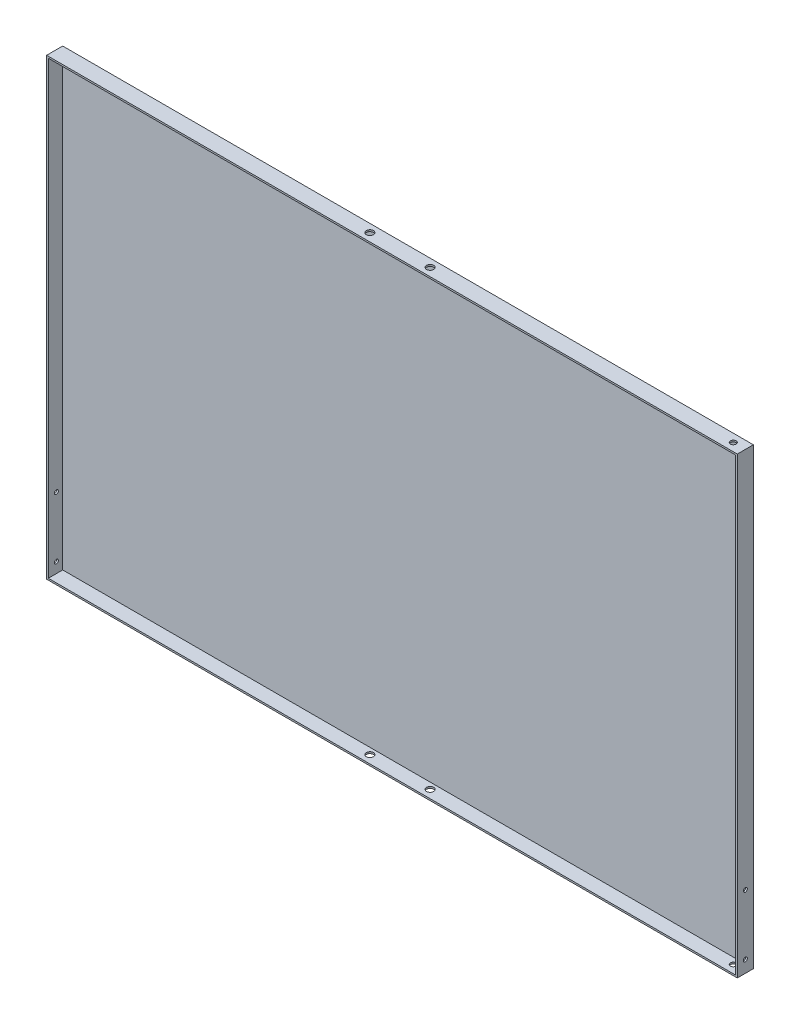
ISO-10303-21;
HEADER;
FILE_DESCRIPTION(('STEP AP214'),'2;1');
FILE_NAME('part.step','',(''),(''),'','','');
FILE_SCHEMA(('AUTOMOTIVE_DESIGN { 1 0 10303 214 1 1 1 1 }'));
ENDSEC;
DATA;
#1=APPLICATION_CONTEXT('core data for automotive mechanical design processes');
#2=APPLICATION_PROTOCOL_DEFINITION('international standard','automotive_design',2000,#1);
#3=PRODUCT_CONTEXT('',#1,'mechanical');
#4=PRODUCT('Part','Part','',(#3));
#5=PRODUCT_RELATED_PRODUCT_CATEGORY('part','',(#4));
#6=PRODUCT_DEFINITION_FORMATION('','',#4);
#7=PRODUCT_DEFINITION_CONTEXT('part definition',#1,'design');
#8=PRODUCT_DEFINITION('design','',#6,#7);
#9=PRODUCT_DEFINITION_SHAPE('','',#8);
#10=(LENGTH_UNIT() NAMED_UNIT(*) SI_UNIT(.MILLI.,.METRE.));
#11=(NAMED_UNIT(*) PLANE_ANGLE_UNIT() SI_UNIT($,.RADIAN.));
#12=(NAMED_UNIT(*) SI_UNIT($,.STERADIAN.) SOLID_ANGLE_UNIT());
#13=UNCERTAINTY_MEASURE_WITH_UNIT(LENGTH_MEASURE(1.E-05),#10,'distance_accuracy_value','');
#14=(GEOMETRIC_REPRESENTATION_CONTEXT(3) GLOBAL_UNCERTAINTY_ASSIGNED_CONTEXT((#13)) GLOBAL_UNIT_ASSIGNED_CONTEXT((#10,
#11,#12)) REPRESENTATION_CONTEXT('',''));
#15=CARTESIAN_POINT('',(0.,0.,0.));
#16=DIRECTION('',(0.,0.,1.));
#17=DIRECTION('',(1.,0.,0.));
#18=AXIS2_PLACEMENT_3D('',#15,#16,#17);
#19=CARTESIAN_POINT('',(-860.,-565.,40.));
#20=DIRECTION('',(1.,0.,0.));
#21=DIRECTION('',(0.,0.,-1.));
#22=AXIS2_PLACEMENT_3D('',#19,#20,#21);
#23=PLANE('',#22);
#24=CARTESIAN_POINT('',(-860.,-385.,19.9999999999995));
#25=DIRECTION('',(1.,0.,0.));
#26=DIRECTION('',(0.,0.,-1.));
#27=AXIS2_PLACEMENT_3D('',#24,#25,#26);
#28=CIRCLE('',#27,5.);
#29=CARTESIAN_POINT('',(-860.,-385.,14.9999999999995));
#30=VERTEX_POINT('',#29);
#31=EDGE_CURVE('E185',#30,#30,#28,.T.);
#32=ORIENTED_EDGE('',*,*,#31,.T.);
#33=EDGE_LOOP('',(#32));
#34=FACE_BOUND('',#33,.T.);
#35=CARTESIAN_POINT('',(-860.,-535.,20.));
#36=DIRECTION('',(1.,0.,0.));
#37=DIRECTION('',(0.,0.,-1.));
#38=AXIS2_PLACEMENT_3D('',#35,#36,#37);
#39=CIRCLE('',#38,5.);
#40=CARTESIAN_POINT('',(-860.,-535.,15.));
#41=VERTEX_POINT('',#40);
#42=EDGE_CURVE('E182',#41,#41,#39,.T.);
#43=ORIENTED_EDGE('',*,*,#42,.T.);
#44=EDGE_LOOP('',(#43));
#45=FACE_BOUND('',#44,.T.);
#46=DIRECTION('',(0.,-1.,0.));
#47=VECTOR('',#46,1.);
#48=CARTESIAN_POINT('',(-860.,-565.,0.));
#49=LINE('',#48,#47);
#50=CARTESIAN_POINT('',(-860.,565.,0.));
#51=VERTEX_POINT('',#50);
#52=CARTESIAN_POINT('',(-860.,-565.,0.));
#53=VERTEX_POINT('',#52);
#54=EDGE_CURVE('E149',#51,#53,#49,.T.);
#55=ORIENTED_EDGE('',*,*,#54,.T.);
#56=DIRECTION('',(0.,0.,-1.));
#57=VECTOR('',#56,1.);
#58=CARTESIAN_POINT('',(-860.,-565.,40.));
#59=LINE('',#58,#57);
#60=CARTESIAN_POINT('',(-860.,-565.,40.));
#61=VERTEX_POINT('',#60);
#62=EDGE_CURVE('E11',#61,#53,#59,.T.);
#63=ORIENTED_EDGE('',*,*,#62,.F.);
#64=DIRECTION('',(0.,-1.,0.));
#65=VECTOR('',#64,1.);
#66=CARTESIAN_POINT('',(-860.,-565.,40.));
#67=LINE('',#66,#65);
#68=CARTESIAN_POINT('',(-860.,565.,40.));
#69=VERTEX_POINT('',#68);
#70=EDGE_CURVE('E142',#69,#61,#67,.T.);
#71=ORIENTED_EDGE('',*,*,#70,.F.);
#72=DIRECTION('',(0.,0.,-1.));
#73=VECTOR('',#72,1.);
#74=CARTESIAN_POINT('',(-860.,565.,40.));
#75=LINE('',#74,#73);
#76=EDGE_CURVE('E148',#69,#51,#75,.T.);
#77=ORIENTED_EDGE('',*,*,#76,.T.);
#78=EDGE_LOOP('',(#55,#63,#71,#77));
#79=FACE_BOUND('',#78,.T.);
#80=ADVANCED_FACE('F33',(#34,#45,#79),#23,.F.);
#81=CARTESIAN_POINT('',(860.,-565.,40.));
#82=DIRECTION('',(0.,1.,0.));
#83=DIRECTION('',(-1.,0.,0.));
#84=AXIS2_PLACEMENT_3D('',#81,#82,#83);
#85=PLANE('',#84);
#86=CARTESIAN_POINT('',(-74.9999999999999,-565.,19.9999999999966));
#87=DIRECTION('',(0.,1.,0.));
#88=DIRECTION('',(-1.,0.,0.));
#89=AXIS2_PLACEMENT_3D('',#86,#87,#88);
#90=CIRCLE('',#89,8.95251953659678);
#91=CARTESIAN_POINT('',(-83.9525195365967,-565.,19.9999999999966));
#92=VERTEX_POINT('',#91);
#93=EDGE_CURVE('E171',#92,#92,#90,.T.);
#94=ORIENTED_EDGE('',*,*,#93,.T.);
#95=EDGE_LOOP('',(#94));
#96=FACE_BOUND('',#95,.T.);
#97=CARTESIAN_POINT('',(75.0000000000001,-565.,19.9999999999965));
#98=DIRECTION('',(0.,1.,0.));
#99=DIRECTION('',(1.,0.,0.));
#100=AXIS2_PLACEMENT_3D('',#97,#98,#99);
#101=CIRCLE('',#100,8.95251953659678);
#102=CARTESIAN_POINT('',(83.9525195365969,-565.,19.9999999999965));
#103=VERTEX_POINT('',#102);
#104=EDGE_CURVE('E202',#103,#103,#101,.T.);
#105=ORIENTED_EDGE('',*,*,#104,.T.);
#106=EDGE_LOOP('',(#105));
#107=FACE_BOUND('',#106,.T.);
#108=CARTESIAN_POINT('',(830.,-565.,19.9999999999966));
#109=DIRECTION('',(0.,1.,0.));
#110=DIRECTION('',(-1.,0.,0.));
#111=AXIS2_PLACEMENT_3D('',#108,#109,#110);
#112=CIRCLE('',#111,7.18021218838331);
#113=CARTESIAN_POINT('',(822.819787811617,-565.,19.9999999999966));
#114=VERTEX_POINT('',#113);
#115=EDGE_CURVE('E166',#114,#114,#112,.T.);
#116=ORIENTED_EDGE('',*,*,#115,.T.);
#117=EDGE_LOOP('',(#116));
#118=FACE_BOUND('',#117,.T.);
#119=DIRECTION('',(1.,0.,0.));
#120=VECTOR('',#119,1.);
#121=CARTESIAN_POINT('',(860.,-565.,0.));
#122=LINE('',#121,#120);
#123=CARTESIAN_POINT('',(860.,-565.,0.));
#124=VERTEX_POINT('',#123);
#125=EDGE_CURVE('E152',#53,#124,#122,.T.);
#126=ORIENTED_EDGE('',*,*,#125,.T.);
#127=DIRECTION('',(0.,0.,-1.));
#128=VECTOR('',#127,1.);
#129=CARTESIAN_POINT('',(860.,-565.,40.));
#130=LINE('',#129,#128);
#131=CARTESIAN_POINT('',(860.,-565.,40.));
#132=VERTEX_POINT('',#131);
#133=EDGE_CURVE('E41',#132,#124,#130,.T.);
#134=ORIENTED_EDGE('',*,*,#133,.F.);
#135=DIRECTION('',(1.,0.,0.));
#136=VECTOR('',#135,1.);
#137=CARTESIAN_POINT('',(860.,-565.,40.));
#138=LINE('',#137,#136);
#139=EDGE_CURVE('E86',#61,#132,#138,.T.);
#140=ORIENTED_EDGE('',*,*,#139,.F.);
#141=ORIENTED_EDGE('',*,*,#62,.T.);
#142=EDGE_LOOP('',(#126,#134,#140,#141));
#143=FACE_BOUND('',#142,.T.);
#144=ADVANCED_FACE('F237',(#96,#107,#118,#143),#85,.F.);
#145=CARTESIAN_POINT('',(860.,-565.,40.));
#146=DIRECTION('',(-1.,0.,0.));
#147=DIRECTION('',(0.,0.,1.));
#148=AXIS2_PLACEMENT_3D('',#145,#146,#147);
#149=PLANE('',#148);
#150=CARTESIAN_POINT('',(860.,-385.,19.9999999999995));
#151=DIRECTION('',(-1.,0.,0.));
#152=DIRECTION('',(0.,0.,1.));
#153=AXIS2_PLACEMENT_3D('',#150,#151,#152);
#154=CIRCLE('',#153,5.);
#155=CARTESIAN_POINT('',(860.,-385.,24.9999999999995));
#156=VERTEX_POINT('',#155);
#157=EDGE_CURVE('E371',#156,#156,#154,.T.);
#158=ORIENTED_EDGE('',*,*,#157,.T.);
#159=EDGE_LOOP('',(#158));
#160=FACE_BOUND('',#159,.T.);
#161=CARTESIAN_POINT('',(860.,-535.,20.));
#162=DIRECTION('',(-1.,0.,0.));
#163=DIRECTION('',(0.,0.,1.));
#164=AXIS2_PLACEMENT_3D('',#161,#162,#163);
#165=CIRCLE('',#164,5.);
#166=CARTESIAN_POINT('',(860.,-535.,25.));
#167=VERTEX_POINT('',#166);
#168=EDGE_CURVE('E178',#167,#167,#165,.T.);
#169=ORIENTED_EDGE('',*,*,#168,.T.);
#170=EDGE_LOOP('',(#169));
#171=FACE_BOUND('',#170,.T.);
#172=DIRECTION('',(0.,1.,0.));
#173=VECTOR('',#172,1.);
#174=CARTESIAN_POINT('',(860.,-565.,0.));
#175=LINE('',#174,#173);
#176=CARTESIAN_POINT('',(860.,565.,0.));
#177=VERTEX_POINT('',#176);
#178=EDGE_CURVE('E154',#124,#177,#175,.T.);
#179=ORIENTED_EDGE('',*,*,#178,.T.);
#180=DIRECTION('',(0.,0.,-1.));
#181=VECTOR('',#180,1.);
#182=CARTESIAN_POINT('',(860.,565.,40.));
#183=LINE('',#182,#181);
#184=CARTESIAN_POINT('',(860.,565.,40.));
#185=VERTEX_POINT('',#184);
#186=EDGE_CURVE('E158',#185,#177,#183,.T.);
#187=ORIENTED_EDGE('',*,*,#186,.F.);
#188=DIRECTION('',(0.,1.,0.));
#189=VECTOR('',#188,1.);
#190=CARTESIAN_POINT('',(860.,-565.,40.));
#191=LINE('',#190,#189);
#192=EDGE_CURVE('E145',#132,#185,#191,.T.);
#193=ORIENTED_EDGE('',*,*,#192,.F.);
#194=ORIENTED_EDGE('',*,*,#133,.T.);
#195=EDGE_LOOP('',(#179,#187,#193,#194));
#196=FACE_BOUND('',#195,.T.);
#197=ADVANCED_FACE('F242',(#160,#171,#196),#149,.F.);
#198=CARTESIAN_POINT('',(860.,565.,40.));
#199=DIRECTION('',(0.,-1.,0.));
#200=DIRECTION('',(1.,0.,0.));
#201=AXIS2_PLACEMENT_3D('',#198,#199,#200);
#202=PLANE('',#201);
#203=CARTESIAN_POINT('',(-75.0000000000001,565.,19.9999999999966));
#204=DIRECTION('',(0.,1.,0.));
#205=DIRECTION('',(-1.,0.,0.));
#206=AXIS2_PLACEMENT_3D('',#203,#204,#205);
#207=CIRCLE('',#206,8.95251953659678);
#208=CARTESIAN_POINT('',(-83.9525195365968,565.,19.9999999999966));
#209=VERTEX_POINT('',#208);
#210=EDGE_CURVE('E199',#209,#209,#207,.T.);
#211=ORIENTED_EDGE('',*,*,#210,.F.);
#212=EDGE_LOOP('',(#211));
#213=FACE_BOUND('',#212,.T.);
#214=CARTESIAN_POINT('',(74.9999999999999,565.,19.9999999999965));
#215=DIRECTION('',(0.,1.,0.));
#216=DIRECTION('',(1.,0.,0.));
#217=AXIS2_PLACEMENT_3D('',#214,#215,#216);
#218=CIRCLE('',#217,8.95251953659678);
#219=CARTESIAN_POINT('',(83.9525195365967,565.,19.9999999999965));
#220=VERTEX_POINT('',#219);
#221=EDGE_CURVE('E196',#220,#220,#218,.T.);
#222=ORIENTED_EDGE('',*,*,#221,.F.);
#223=EDGE_LOOP('',(#222));
#224=FACE_BOUND('',#223,.T.);
#225=CARTESIAN_POINT('',(830.,565.,19.9999999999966));
#226=DIRECTION('',(0.,1.,0.));
#227=DIRECTION('',(-1.,0.,0.));
#228=AXIS2_PLACEMENT_3D('',#225,#226,#227);
#229=CIRCLE('',#228,7.18021218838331);
#230=CARTESIAN_POINT('',(822.819787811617,565.,19.9999999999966));
#231=VERTEX_POINT('',#230);
#232=EDGE_CURVE('E211',#231,#231,#229,.T.);
#233=ORIENTED_EDGE('',*,*,#232,.F.);
#234=EDGE_LOOP('',(#233));
#235=FACE_BOUND('',#234,.T.);
#236=DIRECTION('',(-1.,0.,0.));
#237=VECTOR('',#236,1.);
#238=CARTESIAN_POINT('',(860.,565.,0.));
#239=LINE('',#238,#237);
#240=EDGE_CURVE('E79',#177,#51,#239,.T.);
#241=ORIENTED_EDGE('',*,*,#240,.T.);
#242=ORIENTED_EDGE('',*,*,#76,.F.);
#243=DIRECTION('',(-1.,0.,0.));
#244=VECTOR('',#243,1.);
#245=CARTESIAN_POINT('',(860.,565.,40.));
#246=LINE('',#245,#244);
#247=EDGE_CURVE('E58',#185,#69,#246,.T.);
#248=ORIENTED_EDGE('',*,*,#247,.F.);
#249=ORIENTED_EDGE('',*,*,#186,.T.);
#250=EDGE_LOOP('',(#241,#242,#248,#249));
#251=FACE_BOUND('',#250,.T.);
#252=ADVANCED_FACE('F231',(#213,#224,#235,#251),#202,.F.);
#253=CARTESIAN_POINT('',(0.,0.,40.));
#254=DIRECTION('',(0.,0.,1.));
#255=DIRECTION('',(1.,0.,0.));
#256=AXIS2_PLACEMENT_3D('',#253,#254,#255);
#257=PLANE('',#256);
#258=DIRECTION('',(0.,-1.,0.));
#259=VECTOR('',#258,1.);
#260=CARTESIAN_POINT('',(-855.775639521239,-565.,40.));
#261=LINE('',#260,#259);
#262=CARTESIAN_POINT('',(-855.775639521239,560.775639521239,40.));
#263=VERTEX_POINT('',#262);
#264=CARTESIAN_POINT('',(-855.775639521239,-560.775639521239,40.));
#265=VERTEX_POINT('',#264);
#266=EDGE_CURVE('E131',#263,#265,#261,.T.);
#267=ORIENTED_EDGE('',*,*,#266,.F.);
#268=DIRECTION('',(-1.,0.,0.));
#269=VECTOR('',#268,1.);
#270=CARTESIAN_POINT('',(860.,560.775639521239,40.));
#271=LINE('',#270,#269);
#272=CARTESIAN_POINT('',(855.775639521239,560.775639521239,40.));
#273=VERTEX_POINT('',#272);
#274=EDGE_CURVE('E140',#273,#263,#271,.T.);
#275=ORIENTED_EDGE('',*,*,#274,.F.);
#276=DIRECTION('',(0.,1.,0.));
#277=VECTOR('',#276,1.);
#278=CARTESIAN_POINT('',(855.775639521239,-565.,40.));
#279=LINE('',#278,#277);
#280=CARTESIAN_POINT('',(855.775639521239,-560.775639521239,40.));
#281=VERTEX_POINT('',#280);
#282=EDGE_CURVE('E138',#281,#273,#279,.T.);
#283=ORIENTED_EDGE('',*,*,#282,.F.);
#284=DIRECTION('',(1.,0.,0.));
#285=VECTOR('',#284,1.);
#286=CARTESIAN_POINT('',(860.,-560.775639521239,40.));
#287=LINE('',#286,#285);
#288=EDGE_CURVE('E123',#265,#281,#287,.T.);
#289=ORIENTED_EDGE('',*,*,#288,.F.);
#290=EDGE_LOOP('',(#267,#275,#283,#289));
#291=FACE_BOUND('',#290,.T.);
#292=ORIENTED_EDGE('',*,*,#70,.T.);
#293=ORIENTED_EDGE('',*,*,#139,.T.);
#294=ORIENTED_EDGE('',*,*,#192,.T.);
#295=ORIENTED_EDGE('',*,*,#247,.T.);
#296=EDGE_LOOP('',(#292,#293,#294,#295));
#297=FACE_BOUND('',#296,.T.);
#298=ADVANCED_FACE('F228',(#291,#297),#257,.T.);
#299=CARTESIAN_POINT('',(0.,0.,0.));
#300=DIRECTION('',(0.,0.,1.));
#301=DIRECTION('',(1.,0.,0.));
#302=AXIS2_PLACEMENT_3D('',#299,#300,#301);
#303=PLANE('',#302);
#304=ORIENTED_EDGE('',*,*,#54,.F.);
#305=ORIENTED_EDGE('',*,*,#240,.F.);
#306=ORIENTED_EDGE('',*,*,#178,.F.);
#307=ORIENTED_EDGE('',*,*,#125,.F.);
#308=EDGE_LOOP('',(#304,#305,#306,#307));
#309=FACE_BOUND('',#308,.T.);
#310=ADVANCED_FACE('F230',(#309),#303,.F.);
#311=CARTESIAN_POINT('',(-855.775639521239,-565.,40.));
#312=DIRECTION('',(1.,0.,0.));
#313=DIRECTION('',(0.,0.,-1.));
#314=AXIS2_PLACEMENT_3D('',#311,#312,#313);
#315=PLANE('',#314);
#316=CARTESIAN_POINT('',(-855.775639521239,-385.,19.9999999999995));
#317=DIRECTION('',(1.,0.,0.));
#318=DIRECTION('',(0.,0.,-1.));
#319=AXIS2_PLACEMENT_3D('',#316,#317,#318);
#320=CIRCLE('',#319,5.);
#321=CARTESIAN_POINT('',(-855.775639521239,-385.,14.9999999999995));
#322=VERTEX_POINT('',#321);
#323=EDGE_CURVE('E190',#322,#322,#320,.T.);
#324=ORIENTED_EDGE('',*,*,#323,.F.);
#325=EDGE_LOOP('',(#324));
#326=FACE_BOUND('',#325,.T.);
#327=CARTESIAN_POINT('',(-855.775639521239,-535.,20.));
#328=DIRECTION('',(1.,0.,0.));
#329=DIRECTION('',(0.,0.,-1.));
#330=AXIS2_PLACEMENT_3D('',#327,#328,#329);
#331=CIRCLE('',#330,5.);
#332=CARTESIAN_POINT('',(-855.775639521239,-535.,15.));
#333=VERTEX_POINT('',#332);
#334=EDGE_CURVE('E177',#333,#333,#331,.T.);
#335=ORIENTED_EDGE('',*,*,#334,.F.);
#336=EDGE_LOOP('',(#335));
#337=FACE_BOUND('',#336,.T.);
#338=DIRECTION('',(0.,-1.,0.));
#339=VECTOR('',#338,1.);
#340=CARTESIAN_POINT('',(-855.775639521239,-565.,4.22436047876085));
#341=LINE('',#340,#339);
#342=CARTESIAN_POINT('',(-855.775639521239,560.775639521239,4.22436047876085));
#343=VERTEX_POINT('',#342);
#344=CARTESIAN_POINT('',(-855.775639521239,-560.775639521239,4.22436047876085));
#345=VERTEX_POINT('',#344);
#346=EDGE_CURVE('E114',#343,#345,#341,.T.);
#347=ORIENTED_EDGE('',*,*,#346,.F.);
#348=DIRECTION('',(0.,0.,-1.));
#349=VECTOR('',#348,1.);
#350=CARTESIAN_POINT('',(-855.775639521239,560.775639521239,40.));
#351=LINE('',#350,#349);
#352=EDGE_CURVE('E134',#263,#343,#351,.T.);
#353=ORIENTED_EDGE('',*,*,#352,.F.);
#354=ORIENTED_EDGE('',*,*,#266,.T.);
#355=DIRECTION('',(0.,0.,-1.));
#356=VECTOR('',#355,1.);
#357=CARTESIAN_POINT('',(-855.775639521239,-560.775639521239,40.));
#358=LINE('',#357,#356);
#359=EDGE_CURVE('E126',#265,#345,#358,.T.);
#360=ORIENTED_EDGE('',*,*,#359,.T.);
#361=EDGE_LOOP('',(#347,#353,#354,#360));
#362=FACE_BOUND('',#361,.T.);
#363=ADVANCED_FACE('F226',(#326,#337,#362),#315,.T.);
#364=CARTESIAN_POINT('',(860.,-560.775639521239,40.));
#365=DIRECTION('',(0.,1.,0.));
#366=DIRECTION('',(-1.,0.,0.));
#367=AXIS2_PLACEMENT_3D('',#364,#365,#366);
#368=PLANE('',#367);
#369=CARTESIAN_POINT('',(-74.9999999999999,-560.775639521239,19.9999999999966));
#370=DIRECTION('',(0.,1.,0.));
#371=DIRECTION('',(-1.,0.,0.));
#372=AXIS2_PLACEMENT_3D('',#369,#370,#371);
#373=CIRCLE('',#372,8.95251953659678);
#374=CARTESIAN_POINT('',(-83.9525195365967,-560.775639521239,19.9999999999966));
#375=VERTEX_POINT('',#374);
#376=EDGE_CURVE('E174',#375,#375,#373,.T.);
#377=ORIENTED_EDGE('',*,*,#376,.F.);
#378=EDGE_LOOP('',(#377));
#379=FACE_BOUND('',#378,.T.);
#380=CARTESIAN_POINT('',(75.0000000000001,-560.775639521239,19.9999999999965));
#381=DIRECTION('',(0.,1.,0.));
#382=DIRECTION('',(-1.,0.,0.));
#383=AXIS2_PLACEMENT_3D('',#380,#381,#382);
#384=CIRCLE('',#383,8.95251953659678);
#385=CARTESIAN_POINT('',(66.0474804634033,-560.775639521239,19.9999999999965));
#386=VERTEX_POINT('',#385);
#387=EDGE_CURVE('E170',#386,#386,#384,.T.);
#388=ORIENTED_EDGE('',*,*,#387,.F.);
#389=EDGE_LOOP('',(#388));
#390=FACE_BOUND('',#389,.T.);
#391=CARTESIAN_POINT('',(830.,-560.775639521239,19.9999999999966));
#392=DIRECTION('',(0.,1.,0.));
#393=DIRECTION('',(-1.,0.,0.));
#394=AXIS2_PLACEMENT_3D('',#391,#392,#393);
#395=CIRCLE('',#394,7.18021218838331);
#396=CARTESIAN_POINT('',(822.819787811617,-560.775639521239,19.9999999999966));
#397=VERTEX_POINT('',#396);
#398=EDGE_CURVE('E165',#397,#397,#395,.T.);
#399=ORIENTED_EDGE('',*,*,#398,.F.);
#400=EDGE_LOOP('',(#399));
#401=FACE_BOUND('',#400,.T.);
#402=DIRECTION('',(1.,0.,0.));
#403=VECTOR('',#402,1.);
#404=CARTESIAN_POINT('',(860.,-560.775639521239,4.22436047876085));
#405=LINE('',#404,#403);
#406=CARTESIAN_POINT('',(855.775639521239,-560.775639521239,4.22436047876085));
#407=VERTEX_POINT('',#406);
#408=EDGE_CURVE('E108',#345,#407,#405,.T.);
#409=ORIENTED_EDGE('',*,*,#408,.F.);
#410=ORIENTED_EDGE('',*,*,#359,.F.);
#411=ORIENTED_EDGE('',*,*,#288,.T.);
#412=DIRECTION('',(0.,0.,-1.));
#413=VECTOR('',#412,1.);
#414=CARTESIAN_POINT('',(855.775639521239,-560.775639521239,40.));
#415=LINE('',#414,#413);
#416=EDGE_CURVE('E120',#281,#407,#415,.T.);
#417=ORIENTED_EDGE('',*,*,#416,.T.);
#418=EDGE_LOOP('',(#409,#410,#411,#417));
#419=FACE_BOUND('',#418,.T.);
#420=ADVANCED_FACE('F121',(#379,#390,#401,#419),#368,.T.);
#421=CARTESIAN_POINT('',(855.775639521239,-565.,40.));
#422=DIRECTION('',(-1.,0.,0.));
#423=DIRECTION('',(0.,0.,1.));
#424=AXIS2_PLACEMENT_3D('',#421,#422,#423);
#425=PLANE('',#424);
#426=CARTESIAN_POINT('',(855.775639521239,-385.,19.9999999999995));
#427=DIRECTION('',(-1.,0.,0.));
#428=DIRECTION('',(0.,0.,1.));
#429=AXIS2_PLACEMENT_3D('',#426,#427,#428);
#430=CIRCLE('',#429,5.);
#431=CARTESIAN_POINT('',(855.775639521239,-385.,24.9999999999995));
#432=VERTEX_POINT('',#431);
#433=EDGE_CURVE('E36',#432,#432,#430,.T.);
#434=ORIENTED_EDGE('',*,*,#433,.F.);
#435=EDGE_LOOP('',(#434));
#436=FACE_BOUND('',#435,.T.);
#437=CARTESIAN_POINT('',(855.775639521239,-535.,20.));
#438=DIRECTION('',(-1.,0.,0.));
#439=DIRECTION('',(0.,0.,1.));
#440=AXIS2_PLACEMENT_3D('',#437,#438,#439);
#441=CIRCLE('',#440,5.);
#442=CARTESIAN_POINT('',(855.775639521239,-535.,25.));
#443=VERTEX_POINT('',#442);
#444=EDGE_CURVE('E175',#443,#443,#441,.T.);
#445=ORIENTED_EDGE('',*,*,#444,.F.);
#446=EDGE_LOOP('',(#445));
#447=FACE_BOUND('',#446,.T.);
#448=DIRECTION('',(0.,1.,0.));
#449=VECTOR('',#448,1.);
#450=CARTESIAN_POINT('',(855.775639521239,-565.,4.22436047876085));
#451=LINE('',#450,#449);
#452=CARTESIAN_POINT('',(855.775639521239,560.775639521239,4.22436047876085));
#453=VERTEX_POINT('',#452);
#454=EDGE_CURVE('E112',#407,#453,#451,.T.);
#455=ORIENTED_EDGE('',*,*,#454,.F.);
#456=ORIENTED_EDGE('',*,*,#416,.F.);
#457=ORIENTED_EDGE('',*,*,#282,.T.);
#458=DIRECTION('',(0.,0.,-1.));
#459=VECTOR('',#458,1.);
#460=CARTESIAN_POINT('',(855.775639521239,560.775639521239,40.));
#461=LINE('',#460,#459);
#462=EDGE_CURVE('E49',#273,#453,#461,.T.);
#463=ORIENTED_EDGE('',*,*,#462,.T.);
#464=EDGE_LOOP('',(#455,#456,#457,#463));
#465=FACE_BOUND('',#464,.T.);
#466=ADVANCED_FACE('F128',(#436,#447,#465),#425,.T.);
#467=CARTESIAN_POINT('',(860.,560.775639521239,40.));
#468=DIRECTION('',(0.,-1.,0.));
#469=DIRECTION('',(1.,0.,0.));
#470=AXIS2_PLACEMENT_3D('',#467,#468,#469);
#471=PLANE('',#470);
#472=CARTESIAN_POINT('',(-75.0000000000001,560.775639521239,19.9999999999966));
#473=DIRECTION('',(0.,-1.,0.));
#474=DIRECTION('',(1.,0.,0.));
#475=AXIS2_PLACEMENT_3D('',#472,#473,#474);
#476=CIRCLE('',#475,8.95251953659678);
#477=CARTESIAN_POINT('',(-66.0474804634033,560.775639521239,19.9999999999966));
#478=VERTEX_POINT('',#477);
#479=EDGE_CURVE('E172',#478,#478,#476,.T.);
#480=ORIENTED_EDGE('',*,*,#479,.F.);
#481=EDGE_LOOP('',(#480));
#482=FACE_BOUND('',#481,.T.);
#483=CARTESIAN_POINT('',(74.9999999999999,560.775639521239,19.9999999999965));
#484=DIRECTION('',(0.,-1.,0.));
#485=DIRECTION('',(1.,0.,0.));
#486=AXIS2_PLACEMENT_3D('',#483,#484,#485);
#487=CIRCLE('',#486,8.95251953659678);
#488=CARTESIAN_POINT('',(83.9525195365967,560.775639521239,19.9999999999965));
#489=VERTEX_POINT('',#488);
#490=EDGE_CURVE('E167',#489,#489,#487,.T.);
#491=ORIENTED_EDGE('',*,*,#490,.F.);
#492=EDGE_LOOP('',(#491));
#493=FACE_BOUND('',#492,.T.);
#494=CARTESIAN_POINT('',(830.,560.775639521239,19.9999999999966));
#495=DIRECTION('',(0.,-1.,0.));
#496=DIRECTION('',(1.,0.,0.));
#497=AXIS2_PLACEMENT_3D('',#494,#495,#496);
#498=CIRCLE('',#497,7.18021218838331);
#499=CARTESIAN_POINT('',(837.180212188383,560.775639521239,19.9999999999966));
#500=VERTEX_POINT('',#499);
#501=EDGE_CURVE('E162',#500,#500,#498,.T.);
#502=ORIENTED_EDGE('',*,*,#501,.F.);
#503=EDGE_LOOP('',(#502));
#504=FACE_BOUND('',#503,.T.);
#505=DIRECTION('',(-1.,0.,0.));
#506=VECTOR('',#505,1.);
#507=CARTESIAN_POINT('',(860.,560.775639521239,4.22436047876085));
#508=LINE('',#507,#506);
#509=EDGE_CURVE('E129',#453,#343,#508,.T.);
#510=ORIENTED_EDGE('',*,*,#509,.F.);
#511=ORIENTED_EDGE('',*,*,#462,.F.);
#512=ORIENTED_EDGE('',*,*,#274,.T.);
#513=ORIENTED_EDGE('',*,*,#352,.T.);
#514=EDGE_LOOP('',(#510,#511,#512,#513));
#515=FACE_BOUND('',#514,.T.);
#516=ADVANCED_FACE('F222',(#482,#493,#504,#515),#471,.T.);
#517=CARTESIAN_POINT('',(0.,0.,4.22436047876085));
#518=DIRECTION('',(0.,0.,1.));
#519=DIRECTION('',(1.,0.,0.));
#520=AXIS2_PLACEMENT_3D('',#517,#518,#519);
#521=PLANE('',#520);
#522=ORIENTED_EDGE('',*,*,#346,.T.);
#523=ORIENTED_EDGE('',*,*,#408,.T.);
#524=ORIENTED_EDGE('',*,*,#454,.T.);
#525=ORIENTED_EDGE('',*,*,#509,.T.);
#526=EDGE_LOOP('',(#522,#523,#524,#525));
#527=FACE_BOUND('',#526,.T.);
#528=ADVANCED_FACE('F110',(#527),#521,.T.);
#529=CARTESIAN_POINT('',(830.,-565.,19.9999999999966));
#530=DIRECTION('',(0.,1.,0.));
#531=DIRECTION('',(-1.,0.,0.));
#532=AXIS2_PLACEMENT_3D('',#529,#530,#531);
#533=CYLINDRICAL_SURFACE('',#532,7.18021218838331);
#534=ORIENTED_EDGE('',*,*,#501,.T.);
#535=EDGE_LOOP('',(#534));
#536=FACE_BOUND('',#535,.T.);
#537=ORIENTED_EDGE('',*,*,#232,.T.);
#538=EDGE_LOOP('',(#537));
#539=FACE_BOUND('',#538,.T.);
#540=ADVANCED_FACE('F287',(#536,#539),#533,.F.);
#541=ORIENTED_EDGE('',*,*,#398,.T.);
#542=EDGE_LOOP('',(#541));
#543=FACE_BOUND('',#542,.T.);
#544=ORIENTED_EDGE('',*,*,#115,.F.);
#545=EDGE_LOOP('',(#544));
#546=FACE_BOUND('',#545,.T.);
#547=ADVANCED_FACE('F285',(#543,#546),#533,.F.);
#548=CARTESIAN_POINT('',(75.0000000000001,-565.,19.9999999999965));
#549=DIRECTION('',(0.,1.,0.));
#550=DIRECTION('',(-1.,0.,0.));
#551=AXIS2_PLACEMENT_3D('',#548,#549,#550);
#552=CYLINDRICAL_SURFACE('',#551,8.95251953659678);
#553=ORIENTED_EDGE('',*,*,#490,.T.);
#554=EDGE_LOOP('',(#553));
#555=FACE_BOUND('',#554,.T.);
#556=ORIENTED_EDGE('',*,*,#221,.T.);
#557=EDGE_LOOP('',(#556));
#558=FACE_BOUND('',#557,.T.);
#559=ADVANCED_FACE('F281',(#555,#558),#552,.F.);
#560=CARTESIAN_POINT('',(-74.9999999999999,-565.,19.9999999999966));
#561=DIRECTION('',(0.,1.,0.));
#562=DIRECTION('',(-1.,0.,0.));
#563=AXIS2_PLACEMENT_3D('',#560,#561,#562);
#564=CYLINDRICAL_SURFACE('',#563,8.95251953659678);
#565=ORIENTED_EDGE('',*,*,#479,.T.);
#566=EDGE_LOOP('',(#565));
#567=FACE_BOUND('',#566,.T.);
#568=ORIENTED_EDGE('',*,*,#210,.T.);
#569=EDGE_LOOP('',(#568));
#570=FACE_BOUND('',#569,.T.);
#571=ADVANCED_FACE('F277',(#567,#570),#564,.F.);
#572=ORIENTED_EDGE('',*,*,#387,.T.);
#573=EDGE_LOOP('',(#572));
#574=FACE_BOUND('',#573,.T.);
#575=ORIENTED_EDGE('',*,*,#104,.F.);
#576=EDGE_LOOP('',(#575));
#577=FACE_BOUND('',#576,.T.);
#578=ADVANCED_FACE('F280',(#574,#577),#552,.F.);
#579=ORIENTED_EDGE('',*,*,#376,.T.);
#580=EDGE_LOOP('',(#579));
#581=FACE_BOUND('',#580,.T.);
#582=ORIENTED_EDGE('',*,*,#93,.F.);
#583=EDGE_LOOP('',(#582));
#584=FACE_BOUND('',#583,.T.);
#585=ADVANCED_FACE('F275',(#581,#584),#564,.F.);
#586=CARTESIAN_POINT('',(860.,-535.,20.));
#587=DIRECTION('',(-1.,0.,0.));
#588=DIRECTION('',(0.,0.,1.));
#589=AXIS2_PLACEMENT_3D('',#586,#587,#588);
#590=CYLINDRICAL_SURFACE('',#589,5.);
#591=ORIENTED_EDGE('',*,*,#444,.T.);
#592=EDGE_LOOP('',(#591));
#593=FACE_BOUND('',#592,.T.);
#594=ORIENTED_EDGE('',*,*,#168,.F.);
#595=EDGE_LOOP('',(#594));
#596=FACE_BOUND('',#595,.T.);
#597=ADVANCED_FACE('F265',(#593,#596),#590,.F.);
#598=ORIENTED_EDGE('',*,*,#334,.T.);
#599=EDGE_LOOP('',(#598));
#600=FACE_BOUND('',#599,.T.);
#601=ORIENTED_EDGE('',*,*,#42,.F.);
#602=EDGE_LOOP('',(#601));
#603=FACE_BOUND('',#602,.T.);
#604=ADVANCED_FACE('F262',(#600,#603),#590,.F.);
#605=CARTESIAN_POINT('',(860.,-385.,19.9999999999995));
#606=DIRECTION('',(-1.,0.,0.));
#607=DIRECTION('',(0.,0.,1.));
#608=AXIS2_PLACEMENT_3D('',#605,#606,#607);
#609=CYLINDRICAL_SURFACE('',#608,5.);
#610=ORIENTED_EDGE('',*,*,#433,.T.);
#611=EDGE_LOOP('',(#610));
#612=FACE_BOUND('',#611,.T.);
#613=ORIENTED_EDGE('',*,*,#157,.F.);
#614=EDGE_LOOP('',(#613));
#615=FACE_BOUND('',#614,.T.);
#616=ADVANCED_FACE('F264',(#612,#615),#609,.F.);
#617=ORIENTED_EDGE('',*,*,#323,.T.);
#618=EDGE_LOOP('',(#617));
#619=FACE_BOUND('',#618,.T.);
#620=ORIENTED_EDGE('',*,*,#31,.F.);
#621=EDGE_LOOP('',(#620));
#622=FACE_BOUND('',#621,.T.);
#623=ADVANCED_FACE('F272',(#619,#622),#609,.F.);
#624=CLOSED_SHELL('',(#80,#144,#197,#252,#298,#310,#363,#420,#466,#516,#528,#540,#547,#559,#571,
#578,#585,#597,#604,#616,#623));
#625=MANIFOLD_SOLID_BREP('B2',#624);
#626=ADVANCED_BREP_SHAPE_REPRESENTATION('',(#18,#625),#14);
#627=SHAPE_DEFINITION_REPRESENTATION(#9,#626);
ENDSEC;
END-ISO-10303-21;
